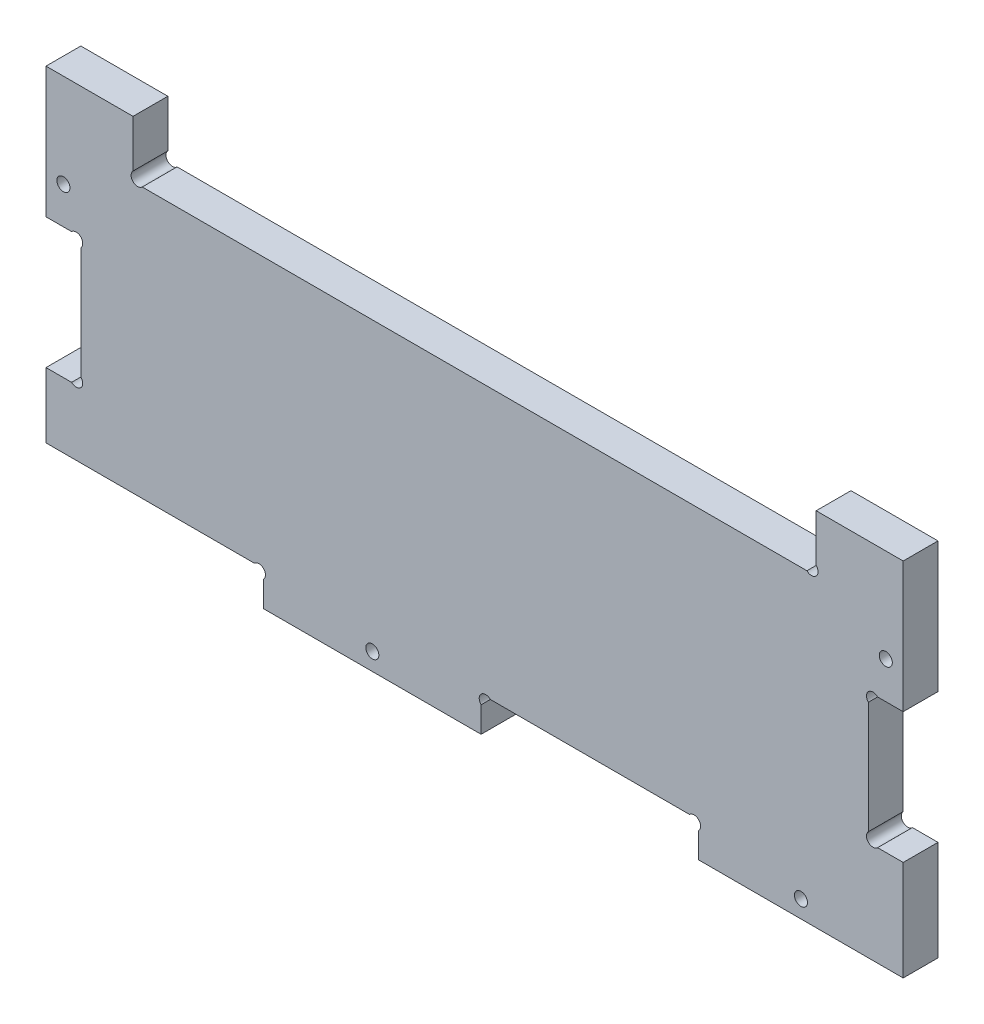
ISO-10303-21;
HEADER;
FILE_DESCRIPTION(('STEP AP214'),'2;1');
FILE_NAME('part.step','',(''),(''),'','','');
FILE_SCHEMA(('AUTOMOTIVE_DESIGN { 1 0 10303 214 1 1 1 1 }'));
ENDSEC;
DATA;
#1=APPLICATION_CONTEXT('core data for automotive mechanical design processes');
#2=APPLICATION_PROTOCOL_DEFINITION('international standard','automotive_design',2000,#1);
#3=PRODUCT_CONTEXT('',#1,'mechanical');
#4=PRODUCT('Part','Part','',(#3));
#5=PRODUCT_RELATED_PRODUCT_CATEGORY('part','',(#4));
#6=PRODUCT_DEFINITION_FORMATION('','',#4);
#7=PRODUCT_DEFINITION_CONTEXT('part definition',#1,'design');
#8=PRODUCT_DEFINITION('design','',#6,#7);
#9=PRODUCT_DEFINITION_SHAPE('','',#8);
#10=(LENGTH_UNIT() NAMED_UNIT(*) SI_UNIT(.MILLI.,.METRE.));
#11=(NAMED_UNIT(*) PLANE_ANGLE_UNIT() SI_UNIT($,.RADIAN.));
#12=(NAMED_UNIT(*) SI_UNIT($,.STERADIAN.) SOLID_ANGLE_UNIT());
#13=UNCERTAINTY_MEASURE_WITH_UNIT(LENGTH_MEASURE(1.E-05),#10,'distance_accuracy_value','');
#14=(GEOMETRIC_REPRESENTATION_CONTEXT(3) GLOBAL_UNCERTAINTY_ASSIGNED_CONTEXT((#13)) GLOBAL_UNIT_ASSIGNED_CONTEXT((#10,
#11,#12)) REPRESENTATION_CONTEXT('',''));
#15=CARTESIAN_POINT('',(0.,0.,0.));
#16=DIRECTION('',(0.,0.,1.));
#17=DIRECTION('',(1.,0.,0.));
#18=AXIS2_PLACEMENT_3D('',#15,#16,#17);
#19=CARTESIAN_POINT('',(2.12366434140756,46.4437720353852,8.));
#20=DIRECTION('',(0.,0.,1.));
#21=DIRECTION('',(1.,0.,0.));
#22=AXIS2_PLACEMENT_3D('',#19,#20,#21);
#23=PLANE('',#22);
#24=CARTESIAN_POINT('',(19.1843245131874,36.883111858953,8.));
#25=DIRECTION('',(0.,0.,1.));
#26=DIRECTION('',(1.,0.,0.));
#27=AXIS2_PLACEMENT_3D('',#24,#25,#26);
#28=CIRCLE('',#27,1.4999999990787);
#29=CARTESIAN_POINT('',(20.6843245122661,36.883111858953,8.));
#30=VERTEX_POINT('',#29);
#31=EDGE_CURVE('E865',#30,#30,#28,.T.);
#32=ORIENTED_EDGE('',*,*,#31,.F.);
#33=EDGE_LOOP('',(#32));
#34=FACE_BOUND('',#33,.T.);
#35=CARTESIAN_POINT('',(-98.8156754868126,-20.616888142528,8.));
#36=DIRECTION('',(0.,0.,1.));
#37=DIRECTION('',(1.,0.,0.));
#38=AXIS2_PLACEMENT_3D('',#35,#36,#37);
#39=CIRCLE('',#38,1.49999999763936);
#40=CARTESIAN_POINT('',(-97.3156754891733,-20.616888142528,8.));
#41=VERTEX_POINT('',#40);
#42=EDGE_CURVE('E269',#41,#41,#39,.T.);
#43=ORIENTED_EDGE('',*,*,#42,.F.);
#44=EDGE_LOOP('',(#43));
#45=FACE_BOUND('',#44,.T.);
#46=DIRECTION('',(0.,1.,0.));
#47=VECTOR('',#46,1.);
#48=CARTESIAN_POINT('',(23.1843245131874,28.3831118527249,8.));
#49=LINE('',#48,#47);
#50=CARTESIAN_POINT('',(23.1843245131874,28.3831118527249,8.));
#51=VERTEX_POINT('',#50);
#52=CARTESIAN_POINT('',(23.1843245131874,58.3831118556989,8.));
#53=VERTEX_POINT('',#52);
#54=EDGE_CURVE('E160',#51,#53,#49,.T.);
#55=ORIENTED_EDGE('',*,*,#54,.T.);
#56=DIRECTION('',(-1.,0.,0.));
#57=VECTOR('',#56,1.);
#58=CARTESIAN_POINT('',(23.1843245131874,58.3831118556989,8.));
#59=LINE('',#58,#57);
#60=CARTESIAN_POINT('',(3.18432451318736,58.3831118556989,8.));
#61=VERTEX_POINT('',#60);
#62=EDGE_CURVE('E492',#53,#61,#59,.T.);
#63=ORIENTED_EDGE('',*,*,#62,.T.);
#64=DIRECTION('',(0.,-1.,0.));
#65=VECTOR('',#64,1.);
#66=CARTESIAN_POINT('',(3.18432451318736,58.3831118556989,8.));
#67=LINE('',#66,#65);
#68=CARTESIAN_POINT('',(3.18432451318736,47.5044322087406,8.));
#69=VERTEX_POINT('',#68);
#70=EDGE_CURVE('E413',#61,#69,#67,.T.);
#71=ORIENTED_EDGE('',*,*,#70,.T.);
#72=CARTESIAN_POINT('',(2.12366434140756,46.4437720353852,8.));
#73=DIRECTION('',(0.,0.,-1.));
#74=DIRECTION('',(1.,0.,0.));
#75=AXIS2_PLACEMENT_3D('',#72,#73,#74);
#76=CIRCLE('',#75,1.50000000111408);
#77=CARTESIAN_POINT('',(1.06300416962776,45.3831118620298,8.));
#78=VERTEX_POINT('',#77);
#79=EDGE_CURVE('E432',#69,#78,#76,.T.);
#80=ORIENTED_EDGE('',*,*,#79,.T.);
#81=DIRECTION('',(-1.,0.,0.));
#82=VECTOR('',#81,1.);
#83=CARTESIAN_POINT('',(-151.694355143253,45.3831118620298,8.));
#84=LINE('',#83,#82);
#85=CARTESIAN_POINT('',(-151.694355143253,45.3831118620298,8.));
#86=VERTEX_POINT('',#85);
#87=EDGE_CURVE('E429',#78,#86,#84,.T.);
#88=ORIENTED_EDGE('',*,*,#87,.T.);
#89=CARTESIAN_POINT('',(-152.755015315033,46.4437720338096,8.));
#90=DIRECTION('',(0.,0.,-1.));
#91=DIRECTION('',(1.,0.,0.));
#92=AXIS2_PLACEMENT_3D('',#89,#90,#91);
#93=CIRCLE('',#92,1.4999999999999);
#94=CARTESIAN_POINT('',(-153.815675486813,47.5044322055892,8.));
#95=VERTEX_POINT('',#94);
#96=EDGE_CURVE('E431',#86,#95,#93,.T.);
#97=ORIENTED_EDGE('',*,*,#96,.T.);
#98=DIRECTION('',(0.,1.,0.));
#99=VECTOR('',#98,1.);
#100=CARTESIAN_POINT('',(-153.815675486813,58.3831118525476,8.));
#101=LINE('',#100,#99);
#102=CARTESIAN_POINT('',(-153.815675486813,58.3831118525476,8.));
#103=VERTEX_POINT('',#102);
#104=EDGE_CURVE('E434',#95,#103,#101,.T.);
#105=ORIENTED_EDGE('',*,*,#104,.T.);
#106=DIRECTION('',(-1.,0.,0.));
#107=VECTOR('',#106,1.);
#108=CARTESIAN_POINT('',(-173.815675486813,58.3831118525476,8.));
#109=LINE('',#108,#107);
#110=CARTESIAN_POINT('',(-173.815675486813,58.3831118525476,8.));
#111=VERTEX_POINT('',#110);
#112=EDGE_CURVE('E440',#103,#111,#109,.T.);
#113=ORIENTED_EDGE('',*,*,#112,.T.);
#114=DIRECTION('',(0.,-1.,0.));
#115=VECTOR('',#114,1.);
#116=CARTESIAN_POINT('',(-173.815675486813,45.3831118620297,8.));
#117=LINE('',#116,#115);
#118=CARTESIAN_POINT('',(-173.815675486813,28.3831118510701,8.));
#119=VERTEX_POINT('',#118);
#120=EDGE_CURVE('E442',#111,#119,#117,.T.);
#121=ORIENTED_EDGE('',*,*,#120,.T.);
#122=DIRECTION('',(1.,0.,0.));
#123=VECTOR('',#122,1.);
#124=CARTESIAN_POINT('',(-167.936995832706,28.3831118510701,8.));
#125=LINE('',#124,#123);
#126=CARTESIAN_POINT('',(-167.936995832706,28.3831118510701,8.));
#127=VERTEX_POINT('',#126);
#128=EDGE_CURVE('E444',#119,#127,#125,.T.);
#129=ORIENTED_EDGE('',*,*,#128,.T.);
#130=CARTESIAN_POINT('',(-166.876335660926,27.3224516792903,8.));
#131=DIRECTION('',(0.,0.,-1.));
#132=DIRECTION('',(1.,0.,0.));
#133=AXIS2_PLACEMENT_3D('',#130,#131,#132);
#134=CIRCLE('',#133,1.5);
#135=CARTESIAN_POINT('',(-165.815675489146,26.2617915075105,8.));
#136=VERTEX_POINT('',#135);
#137=EDGE_CURVE('E446',#127,#136,#134,.T.);
#138=ORIENTED_EDGE('',*,*,#137,.T.);
#139=DIRECTION('',(0.,-1.,0.));
#140=VECTOR('',#139,1.);
#141=CARTESIAN_POINT('',(-165.815675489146,0.504432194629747,8.));
#142=LINE('',#141,#140);
#143=CARTESIAN_POINT('',(-165.815675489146,0.504432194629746,8.));
#144=VERTEX_POINT('',#143);
#145=EDGE_CURVE('E448',#136,#144,#142,.T.);
#146=ORIENTED_EDGE('',*,*,#145,.T.);
#147=CARTESIAN_POINT('',(-166.876335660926,-0.556227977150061,8.));
#148=DIRECTION('',(0.,0.,-1.));
#149=DIRECTION('',(1.,0.,0.));
#150=AXIS2_PLACEMENT_3D('',#147,#148,#149);
#151=CIRCLE('',#150,1.5);
#152=CARTESIAN_POINT('',(-167.936995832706,-1.61688814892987,8.));
#153=VERTEX_POINT('',#152);
#154=EDGE_CURVE('E450',#144,#153,#151,.T.);
#155=ORIENTED_EDGE('',*,*,#154,.T.);
#156=DIRECTION('',(-1.,0.,0.));
#157=VECTOR('',#156,1.);
#158=CARTESIAN_POINT('',(-173.815675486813,-1.61688814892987,8.));
#159=LINE('',#158,#157);
#160=CARTESIAN_POINT('',(-173.815675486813,-1.61688814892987,8.));
#161=VERTEX_POINT('',#160);
#162=EDGE_CURVE('E452',#153,#161,#159,.T.);
#163=ORIENTED_EDGE('',*,*,#162,.T.);
#164=DIRECTION('',(0.,-1.,0.));
#165=VECTOR('',#164,1.);
#166=CARTESIAN_POINT('',(-173.815675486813,-16.6168881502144,8.));
#167=LINE('',#166,#165);
#168=CARTESIAN_POINT('',(-173.815675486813,-16.6168881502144,8.));
#169=VERTEX_POINT('',#168);
#170=EDGE_CURVE('E454',#161,#169,#167,.T.);
#171=ORIENTED_EDGE('',*,*,#170,.T.);
#172=DIRECTION('',(1.,0.,0.));
#173=VECTOR('',#172,1.);
#174=CARTESIAN_POINT('',(-125.936995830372,-16.6168881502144,8.));
#175=LINE('',#174,#173);
#176=CARTESIAN_POINT('',(-125.936995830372,-16.6168881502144,8.));
#177=VERTEX_POINT('',#176);
#178=EDGE_CURVE('E456',#169,#177,#175,.T.);
#179=ORIENTED_EDGE('',*,*,#178,.T.);
#180=CARTESIAN_POINT('',(-124.876335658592,-17.6775483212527,8.));
#181=DIRECTION('',(0.,0.,-1.));
#182=DIRECTION('',(1.,0.,0.));
#183=AXIS2_PLACEMENT_3D('',#180,#181,#182);
#184=CIRCLE('',#183,1.49999999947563);
#185=CARTESIAN_POINT('',(-123.815675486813,-18.738208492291,8.));
#186=VERTEX_POINT('',#185);
#187=EDGE_CURVE('E458',#177,#186,#184,.T.);
#188=ORIENTED_EDGE('',*,*,#187,.T.);
#189=DIRECTION('',(0.,-1.,0.));
#190=VECTOR('',#189,1.);
#191=CARTESIAN_POINT('',(-123.815675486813,-24.6168881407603,8.));
#192=LINE('',#191,#190);
#193=CARTESIAN_POINT('',(-123.815675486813,-24.6168881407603,8.));
#194=VERTEX_POINT('',#193);
#195=EDGE_CURVE('E460',#186,#194,#192,.T.);
#196=ORIENTED_EDGE('',*,*,#195,.T.);
#197=DIRECTION('',(1.,0.,0.));
#198=VECTOR('',#197,1.);
#199=CARTESIAN_POINT('',(-73.8156754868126,-24.6168881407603,8.));
#200=LINE('',#199,#198);
#201=CARTESIAN_POINT('',(-73.8156754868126,-24.6168881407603,8.));
#202=VERTEX_POINT('',#201);
#203=EDGE_CURVE('E462',#194,#202,#200,.T.);
#204=ORIENTED_EDGE('',*,*,#203,.T.);
#205=DIRECTION('',(0.,1.,0.));
#206=VECTOR('',#205,1.);
#207=CARTESIAN_POINT('',(-73.8156754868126,-18.738208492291,8.));
#208=LINE('',#207,#206);
#209=CARTESIAN_POINT('',(-73.8156754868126,-18.738208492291,8.));
#210=VERTEX_POINT('',#209);
#211=EDGE_CURVE('E464',#202,#210,#208,.T.);
#212=ORIENTED_EDGE('',*,*,#211,.T.);
#213=CARTESIAN_POINT('',(-72.7550153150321,-17.6775483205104,8.));
#214=DIRECTION('',(0.,0.,-1.));
#215=DIRECTION('',(1.,0.,0.));
#216=AXIS2_PLACEMENT_3D('',#213,#214,#215);
#217=CIRCLE('',#216,1.50000000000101);
#218=CARTESIAN_POINT('',(-71.694355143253,-16.6168881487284,8.));
#219=VERTEX_POINT('',#218);
#220=EDGE_CURVE('E466',#210,#219,#217,.T.);
#221=ORIENTED_EDGE('',*,*,#220,.T.);
#222=DIRECTION('',(1.,0.,0.));
#223=VECTOR('',#222,1.);
#224=CARTESIAN_POINT('',(-71.694355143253,-16.6168881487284,8.));
#225=LINE('',#224,#223);
#226=CARTESIAN_POINT('',(-25.9369958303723,-16.6168881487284,8.));
#227=VERTEX_POINT('',#226);
#228=EDGE_CURVE('E468',#219,#227,#225,.T.);
#229=ORIENTED_EDGE('',*,*,#228,.T.);
#230=CARTESIAN_POINT('',(-24.8763356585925,-17.6775483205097,8.));
#231=DIRECTION('',(0.,0.,-1.));
#232=DIRECTION('',(1.,0.,0.));
#233=AXIS2_PLACEMENT_3D('',#230,#231,#232);
#234=CIRCLE('',#233,1.50000000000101);
#235=CARTESIAN_POINT('',(-23.8156754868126,-18.7382084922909,8.));
#236=VERTEX_POINT('',#235);
#237=EDGE_CURVE('E470',#227,#236,#234,.T.);
#238=ORIENTED_EDGE('',*,*,#237,.T.);
#239=DIRECTION('',(0.,-1.,0.));
#240=VECTOR('',#239,1.);
#241=CARTESIAN_POINT('',(-23.8156754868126,-24.6168881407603,8.));
#242=LINE('',#241,#240);
#243=CARTESIAN_POINT('',(-23.8156754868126,-24.6168881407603,8.));
#244=VERTEX_POINT('',#243);
#245=EDGE_CURVE('E472',#236,#244,#242,.T.);
#246=ORIENTED_EDGE('',*,*,#245,.T.);
#247=DIRECTION('',(1.,2.68797543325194E-10,0.));
#248=VECTOR('',#247,1.);
#249=CARTESIAN_POINT('',(23.1843245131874,-24.6168881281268,8.));
#250=LINE('',#249,#248);
#251=CARTESIAN_POINT('',(23.1843245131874,-24.6168881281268,8.));
#252=VERTEX_POINT('',#251);
#253=EDGE_CURVE('E474',#244,#252,#250,.T.);
#254=ORIENTED_EDGE('',*,*,#253,.T.);
#255=DIRECTION('',(0.,1.,0.));
#256=VECTOR('',#255,1.);
#257=CARTESIAN_POINT('',(23.1843245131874,-24.6168881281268,8.));
#258=LINE('',#257,#256);
#259=CARTESIAN_POINT('',(23.1843245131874,-1.61688814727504,8.));
#260=VERTEX_POINT('',#259);
#261=EDGE_CURVE('E476',#252,#260,#258,.T.);
#262=ORIENTED_EDGE('',*,*,#261,.T.);
#263=DIRECTION('',(-1.,0.,0.));
#264=VECTOR('',#263,1.);
#265=CARTESIAN_POINT('',(17.3056448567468,-1.61688814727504,8.));
#266=LINE('',#265,#264);
#267=CARTESIAN_POINT('',(17.3056448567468,-1.61688814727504,8.));
#268=VERTEX_POINT('',#267);
#269=EDGE_CURVE('E478',#260,#268,#266,.T.);
#270=ORIENTED_EDGE('',*,*,#269,.T.);
#271=CARTESIAN_POINT('',(16.2449846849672,-0.556227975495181,8.));
#272=DIRECTION('',(0.,0.,-1.));
#273=DIRECTION('',(1.,0.,0.));
#274=AXIS2_PLACEMENT_3D('',#271,#272,#273);
#275=CIRCLE('',#274,1.49999999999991);
#276=CARTESIAN_POINT('',(15.1843245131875,0.504432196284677,8.));
#277=VERTEX_POINT('',#276);
#278=EDGE_CURVE('E249',#268,#277,#275,.T.);
#279=ORIENTED_EDGE('',*,*,#278,.T.);
#280=DIRECTION('',(0.,1.,0.));
#281=VECTOR('',#280,1.);
#282=CARTESIAN_POINT('',(15.1843245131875,26.2617915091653,8.));
#283=LINE('',#282,#281);
#284=CARTESIAN_POINT('',(15.1843245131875,26.2617915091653,8.));
#285=VERTEX_POINT('',#284);
#286=EDGE_CURVE('E243',#277,#285,#283,.T.);
#287=ORIENTED_EDGE('',*,*,#286,.T.);
#288=CARTESIAN_POINT('',(16.2449846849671,27.3224516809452,8.));
#289=DIRECTION('',(0.,0.,-1.));
#290=DIRECTION('',(1.,0.,0.));
#291=AXIS2_PLACEMENT_3D('',#288,#289,#290);
#292=CIRCLE('',#291,1.49999999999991);
#293=CARTESIAN_POINT('',(17.3056448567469,28.3831118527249,8.));
#294=VERTEX_POINT('',#293);
#295=EDGE_CURVE('E247',#285,#294,#292,.T.);
#296=ORIENTED_EDGE('',*,*,#295,.T.);
#297=DIRECTION('',(1.,0.,0.));
#298=VECTOR('',#297,1.);
#299=CARTESIAN_POINT('',(23.1843245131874,28.3831118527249,8.));
#300=LINE('',#299,#298);
#301=EDGE_CURVE('E49',#294,#51,#300,.T.);
#302=ORIENTED_EDGE('',*,*,#301,.T.);
#303=EDGE_LOOP('',(#55,#63,#71,#80,#88,#97,#105,#113,#121,#129,#138,#146,#155,#163,#171,#179,
#188,#196,#204,#212,#221,#229,#238,#246,#254,#262,#270,#279,#287,#296,#302));
#304=FACE_BOUND('',#303,.T.);
#305=CARTESIAN_POINT('',(-0.31567548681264,-20.6168881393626,8.));
#306=DIRECTION('',(0.,0.,1.));
#307=DIRECTION('',(1.,0.,0.));
#308=AXIS2_PLACEMENT_3D('',#305,#306,#307);
#309=CIRCLE('',#308,1.49999999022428);
#310=CARTESIAN_POINT('',(1.18432450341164,-20.6168881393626,8.));
#311=VERTEX_POINT('',#310);
#312=EDGE_CURVE('E871',#311,#311,#309,.T.);
#313=ORIENTED_EDGE('',*,*,#312,.F.);
#314=EDGE_LOOP('',(#313));
#315=FACE_BOUND('',#314,.T.);
#316=CARTESIAN_POINT('',(-169.815675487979,36.8831118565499,8.));
#317=DIRECTION('',(0.,0.,1.));
#318=DIRECTION('',(1.,0.,0.));
#319=AXIS2_PLACEMENT_3D('',#316,#317,#318);
#320=CIRCLE('',#319,1.5);
#321=CARTESIAN_POINT('',(-168.315675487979,36.8831118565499,8.));
#322=VERTEX_POINT('',#321);
#323=EDGE_CURVE('E856',#322,#322,#320,.T.);
#324=ORIENTED_EDGE('',*,*,#323,.F.);
#325=EDGE_LOOP('',(#324));
#326=FACE_BOUND('',#325,.T.);
#327=ADVANCED_FACE('F32',(#34,#45,#304,#315,#326),#23,.T.);
#328=CARTESIAN_POINT('',(2.12366434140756,46.4437720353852,0.));
#329=DIRECTION('',(0.,0.,1.));
#330=DIRECTION('',(1.,0.,0.));
#331=AXIS2_PLACEMENT_3D('',#328,#329,#330);
#332=PLANE('',#331);
#333=CARTESIAN_POINT('',(19.1843245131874,36.883111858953,0.));
#334=DIRECTION('',(0.,0.,1.));
#335=DIRECTION('',(1.,0.,0.));
#336=AXIS2_PLACEMENT_3D('',#333,#334,#335);
#337=CIRCLE('',#336,1.4999999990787);
#338=CARTESIAN_POINT('',(20.6843245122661,36.883111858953,0.));
#339=VERTEX_POINT('',#338);
#340=EDGE_CURVE('E862',#339,#339,#337,.T.);
#341=ORIENTED_EDGE('',*,*,#340,.T.);
#342=EDGE_LOOP('',(#341));
#343=FACE_BOUND('',#342,.T.);
#344=CARTESIAN_POINT('',(-98.8156754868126,-20.616888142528,0.));
#345=DIRECTION('',(0.,0.,1.));
#346=DIRECTION('',(1.,0.,0.));
#347=AXIS2_PLACEMENT_3D('',#344,#345,#346);
#348=CIRCLE('',#347,1.49999999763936);
#349=CARTESIAN_POINT('',(-97.3156754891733,-20.616888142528,0.));
#350=VERTEX_POINT('',#349);
#351=EDGE_CURVE('E496',#350,#350,#348,.T.);
#352=ORIENTED_EDGE('',*,*,#351,.T.);
#353=EDGE_LOOP('',(#352));
#354=FACE_BOUND('',#353,.T.);
#355=DIRECTION('',(0.,1.,0.));
#356=VECTOR('',#355,1.);
#357=CARTESIAN_POINT('',(23.1843245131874,45.383111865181,0.));
#358=LINE('',#357,#356);
#359=CARTESIAN_POINT('',(23.1843245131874,28.3831118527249,0.));
#360=VERTEX_POINT('',#359);
#361=CARTESIAN_POINT('',(23.1843245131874,58.3831118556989,0.));
#362=VERTEX_POINT('',#361);
#363=EDGE_CURVE('E154',#360,#362,#358,.T.);
#364=ORIENTED_EDGE('',*,*,#363,.F.);
#365=DIRECTION('',(1.,0.,0.));
#366=VECTOR('',#365,1.);
#367=CARTESIAN_POINT('',(23.1843245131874,28.3831118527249,0.));
#368=LINE('',#367,#366);
#369=CARTESIAN_POINT('',(17.3056448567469,28.3831118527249,0.));
#370=VERTEX_POINT('',#369);
#371=EDGE_CURVE('E326',#370,#360,#368,.T.);
#372=ORIENTED_EDGE('',*,*,#371,.F.);
#373=CARTESIAN_POINT('',(16.2449846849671,27.3224516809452,0.));
#374=DIRECTION('',(0.,0.,-1.));
#375=DIRECTION('',(1.,0.,0.));
#376=AXIS2_PLACEMENT_3D('',#373,#374,#375);
#377=CIRCLE('',#376,1.49999999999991);
#378=CARTESIAN_POINT('',(15.1843245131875,26.2617915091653,0.));
#379=VERTEX_POINT('',#378);
#380=EDGE_CURVE('E147',#379,#370,#377,.T.);
#381=ORIENTED_EDGE('',*,*,#380,.F.);
#382=DIRECTION('',(0.,1.,0.));
#383=VECTOR('',#382,1.);
#384=CARTESIAN_POINT('',(15.1843245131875,26.2617915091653,0.));
#385=LINE('',#384,#383);
#386=CARTESIAN_POINT('',(15.1843245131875,0.504432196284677,0.));
#387=VERTEX_POINT('',#386);
#388=EDGE_CURVE('E257',#387,#379,#385,.T.);
#389=ORIENTED_EDGE('',*,*,#388,.F.);
#390=CARTESIAN_POINT('',(16.2449846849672,-0.556227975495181,0.));
#391=DIRECTION('',(0.,0.,-1.));
#392=DIRECTION('',(1.,0.,0.));
#393=AXIS2_PLACEMENT_3D('',#390,#391,#392);
#394=CIRCLE('',#393,1.49999999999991);
#395=CARTESIAN_POINT('',(17.3056448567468,-1.61688814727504,0.));
#396=VERTEX_POINT('',#395);
#397=EDGE_CURVE('E322',#396,#387,#394,.T.);
#398=ORIENTED_EDGE('',*,*,#397,.F.);
#399=DIRECTION('',(-1.,0.,0.));
#400=VECTOR('',#399,1.);
#401=CARTESIAN_POINT('',(17.3056448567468,-1.61688814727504,0.));
#402=LINE('',#401,#400);
#403=CARTESIAN_POINT('',(23.1843245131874,-1.61688814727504,0.));
#404=VERTEX_POINT('',#403);
#405=EDGE_CURVE('E320',#404,#396,#402,.T.);
#406=ORIENTED_EDGE('',*,*,#405,.F.);
#407=DIRECTION('',(0.,1.,0.));
#408=VECTOR('',#407,1.);
#409=CARTESIAN_POINT('',(23.1843245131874,-24.6168881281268,0.));
#410=LINE('',#409,#408);
#411=CARTESIAN_POINT('',(23.1843245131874,-24.6168881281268,0.));
#412=VERTEX_POINT('',#411);
#413=EDGE_CURVE('E318',#412,#404,#410,.T.);
#414=ORIENTED_EDGE('',*,*,#413,.F.);
#415=DIRECTION('',(1.,2.68797543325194E-10,0.));
#416=VECTOR('',#415,1.);
#417=CARTESIAN_POINT('',(23.1843245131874,-24.6168881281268,0.));
#418=LINE('',#417,#416);
#419=CARTESIAN_POINT('',(-23.8156754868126,-24.6168881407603,0.));
#420=VERTEX_POINT('',#419);
#421=EDGE_CURVE('E316',#420,#412,#418,.T.);
#422=ORIENTED_EDGE('',*,*,#421,.F.);
#423=DIRECTION('',(0.,-1.,0.));
#424=VECTOR('',#423,1.);
#425=CARTESIAN_POINT('',(-23.8156754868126,-24.6168881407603,0.));
#426=LINE('',#425,#424);
#427=CARTESIAN_POINT('',(-23.8156754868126,-18.7382084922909,0.));
#428=VERTEX_POINT('',#427);
#429=EDGE_CURVE('E314',#428,#420,#426,.T.);
#430=ORIENTED_EDGE('',*,*,#429,.F.);
#431=CARTESIAN_POINT('',(-24.8763356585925,-17.6775483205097,0.));
#432=DIRECTION('',(0.,0.,-1.));
#433=DIRECTION('',(1.,0.,0.));
#434=AXIS2_PLACEMENT_3D('',#431,#432,#433);
#435=CIRCLE('',#434,1.50000000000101);
#436=CARTESIAN_POINT('',(-25.9369958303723,-16.6168881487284,0.));
#437=VERTEX_POINT('',#436);
#438=EDGE_CURVE('E312',#437,#428,#435,.T.);
#439=ORIENTED_EDGE('',*,*,#438,.F.);
#440=DIRECTION('',(1.,0.,0.));
#441=VECTOR('',#440,1.);
#442=CARTESIAN_POINT('',(-71.694355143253,-16.6168881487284,0.));
#443=LINE('',#442,#441);
#444=CARTESIAN_POINT('',(-71.694355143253,-16.6168881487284,0.));
#445=VERTEX_POINT('',#444);
#446=EDGE_CURVE('E310',#445,#437,#443,.T.);
#447=ORIENTED_EDGE('',*,*,#446,.F.);
#448=CARTESIAN_POINT('',(-72.7550153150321,-17.6775483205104,0.));
#449=DIRECTION('',(0.,0.,-1.));
#450=DIRECTION('',(1.,0.,0.));
#451=AXIS2_PLACEMENT_3D('',#448,#449,#450);
#452=CIRCLE('',#451,1.50000000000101);
#453=CARTESIAN_POINT('',(-73.8156754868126,-18.738208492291,0.));
#454=VERTEX_POINT('',#453);
#455=EDGE_CURVE('E308',#454,#445,#452,.T.);
#456=ORIENTED_EDGE('',*,*,#455,.F.);
#457=DIRECTION('',(0.,1.,0.));
#458=VECTOR('',#457,1.);
#459=CARTESIAN_POINT('',(-73.8156754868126,-18.738208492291,0.));
#460=LINE('',#459,#458);
#461=CARTESIAN_POINT('',(-73.8156754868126,-24.6168881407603,0.));
#462=VERTEX_POINT('',#461);
#463=EDGE_CURVE('E306',#462,#454,#460,.T.);
#464=ORIENTED_EDGE('',*,*,#463,.F.);
#465=DIRECTION('',(1.,0.,0.));
#466=VECTOR('',#465,1.);
#467=CARTESIAN_POINT('',(-73.8156754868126,-24.6168881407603,0.));
#468=LINE('',#467,#466);
#469=CARTESIAN_POINT('',(-123.815675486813,-24.6168881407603,0.));
#470=VERTEX_POINT('',#469);
#471=EDGE_CURVE('E304',#470,#462,#468,.T.);
#472=ORIENTED_EDGE('',*,*,#471,.F.);
#473=DIRECTION('',(0.,-1.,0.));
#474=VECTOR('',#473,1.);
#475=CARTESIAN_POINT('',(-123.815675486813,-24.6168881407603,0.));
#476=LINE('',#475,#474);
#477=CARTESIAN_POINT('',(-123.815675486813,-18.738208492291,0.));
#478=VERTEX_POINT('',#477);
#479=EDGE_CURVE('E302',#478,#470,#476,.T.);
#480=ORIENTED_EDGE('',*,*,#479,.F.);
#481=CARTESIAN_POINT('',(-124.876335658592,-17.6775483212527,0.));
#482=DIRECTION('',(0.,0.,-1.));
#483=DIRECTION('',(1.,0.,0.));
#484=AXIS2_PLACEMENT_3D('',#481,#482,#483);
#485=CIRCLE('',#484,1.49999999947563);
#486=CARTESIAN_POINT('',(-125.936995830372,-16.6168881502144,0.));
#487=VERTEX_POINT('',#486);
#488=EDGE_CURVE('E300',#487,#478,#485,.T.);
#489=ORIENTED_EDGE('',*,*,#488,.F.);
#490=DIRECTION('',(1.,0.,0.));
#491=VECTOR('',#490,1.);
#492=CARTESIAN_POINT('',(-125.936995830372,-16.6168881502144,0.));
#493=LINE('',#492,#491);
#494=CARTESIAN_POINT('',(-173.815675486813,-16.6168881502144,0.));
#495=VERTEX_POINT('',#494);
#496=EDGE_CURVE('E298',#495,#487,#493,.T.);
#497=ORIENTED_EDGE('',*,*,#496,.F.);
#498=DIRECTION('',(0.,-1.,0.));
#499=VECTOR('',#498,1.);
#500=CARTESIAN_POINT('',(-173.815675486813,-16.6168881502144,0.));
#501=LINE('',#500,#499);
#502=CARTESIAN_POINT('',(-173.815675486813,-1.61688814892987,0.));
#503=VERTEX_POINT('',#502);
#504=EDGE_CURVE('E296',#503,#495,#501,.T.);
#505=ORIENTED_EDGE('',*,*,#504,.F.);
#506=DIRECTION('',(-1.,0.,0.));
#507=VECTOR('',#506,1.);
#508=CARTESIAN_POINT('',(-173.815675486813,-1.61688814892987,0.));
#509=LINE('',#508,#507);
#510=CARTESIAN_POINT('',(-167.936995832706,-1.61688814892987,0.));
#511=VERTEX_POINT('',#510);
#512=EDGE_CURVE('E294',#511,#503,#509,.T.);
#513=ORIENTED_EDGE('',*,*,#512,.F.);
#514=CARTESIAN_POINT('',(-166.876335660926,-0.556227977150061,0.));
#515=DIRECTION('',(0.,0.,-1.));
#516=DIRECTION('',(1.,0.,0.));
#517=AXIS2_PLACEMENT_3D('',#514,#515,#516);
#518=CIRCLE('',#517,1.5);
#519=CARTESIAN_POINT('',(-165.815675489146,0.504432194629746,0.));
#520=VERTEX_POINT('',#519);
#521=EDGE_CURVE('E292',#520,#511,#518,.T.);
#522=ORIENTED_EDGE('',*,*,#521,.F.);
#523=DIRECTION('',(0.,-1.,0.));
#524=VECTOR('',#523,1.);
#525=CARTESIAN_POINT('',(-165.815675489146,0.504432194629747,0.));
#526=LINE('',#525,#524);
#527=CARTESIAN_POINT('',(-165.815675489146,26.2617915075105,0.));
#528=VERTEX_POINT('',#527);
#529=EDGE_CURVE('E290',#528,#520,#526,.T.);
#530=ORIENTED_EDGE('',*,*,#529,.F.);
#531=CARTESIAN_POINT('',(-166.876335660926,27.3224516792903,0.));
#532=DIRECTION('',(0.,0.,-1.));
#533=DIRECTION('',(1.,0.,0.));
#534=AXIS2_PLACEMENT_3D('',#531,#532,#533);
#535=CIRCLE('',#534,1.5);
#536=CARTESIAN_POINT('',(-167.936995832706,28.3831118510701,0.));
#537=VERTEX_POINT('',#536);
#538=EDGE_CURVE('E288',#537,#528,#535,.T.);
#539=ORIENTED_EDGE('',*,*,#538,.F.);
#540=DIRECTION('',(1.,0.,0.));
#541=VECTOR('',#540,1.);
#542=CARTESIAN_POINT('',(-167.936995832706,28.3831118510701,0.));
#543=LINE('',#542,#541);
#544=CARTESIAN_POINT('',(-173.815675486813,28.3831118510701,0.));
#545=VERTEX_POINT('',#544);
#546=EDGE_CURVE('E286',#545,#537,#543,.T.);
#547=ORIENTED_EDGE('',*,*,#546,.F.);
#548=DIRECTION('',(0.,-1.,0.));
#549=VECTOR('',#548,1.);
#550=CARTESIAN_POINT('',(-173.815675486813,28.3831118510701,0.));
#551=LINE('',#550,#549);
#552=CARTESIAN_POINT('',(-173.815675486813,58.3831118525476,0.));
#553=VERTEX_POINT('',#552);
#554=EDGE_CURVE('E284',#553,#545,#551,.T.);
#555=ORIENTED_EDGE('',*,*,#554,.F.);
#556=DIRECTION('',(-1.,0.,0.));
#557=VECTOR('',#556,1.);
#558=CARTESIAN_POINT('',(-173.815675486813,58.3831118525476,0.));
#559=LINE('',#558,#557);
#560=CARTESIAN_POINT('',(-153.815675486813,58.3831118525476,0.));
#561=VERTEX_POINT('',#560);
#562=EDGE_CURVE('E281',#561,#553,#559,.T.);
#563=ORIENTED_EDGE('',*,*,#562,.F.);
#564=DIRECTION('',(0.,1.,0.));
#565=VECTOR('',#564,1.);
#566=CARTESIAN_POINT('',(-153.815675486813,58.3831118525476,0.));
#567=LINE('',#566,#565);
#568=CARTESIAN_POINT('',(-153.815675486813,47.5044322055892,0.));
#569=VERTEX_POINT('',#568);
#570=EDGE_CURVE('E279',#569,#561,#567,.T.);
#571=ORIENTED_EDGE('',*,*,#570,.F.);
#572=CARTESIAN_POINT('',(-152.755015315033,46.4437720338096,0.));
#573=DIRECTION('',(0.,0.,-1.));
#574=DIRECTION('',(1.,0.,0.));
#575=AXIS2_PLACEMENT_3D('',#572,#573,#574);
#576=CIRCLE('',#575,1.4999999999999);
#577=CARTESIAN_POINT('',(-151.694355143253,45.3831118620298,0.));
#578=VERTEX_POINT('',#577);
#579=EDGE_CURVE('E277',#578,#569,#576,.T.);
#580=ORIENTED_EDGE('',*,*,#579,.F.);
#581=DIRECTION('',(-1.,0.,0.));
#582=VECTOR('',#581,1.);
#583=CARTESIAN_POINT('',(-151.694355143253,45.3831118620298,0.));
#584=LINE('',#583,#582);
#585=CARTESIAN_POINT('',(1.06300416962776,45.3831118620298,0.));
#586=VERTEX_POINT('',#585);
#587=EDGE_CURVE('E275',#586,#578,#584,.T.);
#588=ORIENTED_EDGE('',*,*,#587,.F.);
#589=CARTESIAN_POINT('',(2.12366434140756,46.4437720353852,0.));
#590=DIRECTION('',(0.,0.,-1.));
#591=DIRECTION('',(1.,0.,0.));
#592=AXIS2_PLACEMENT_3D('',#589,#590,#591);
#593=CIRCLE('',#592,1.50000000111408);
#594=CARTESIAN_POINT('',(3.18432451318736,47.5044322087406,0.));
#595=VERTEX_POINT('',#594);
#596=EDGE_CURVE('E273',#595,#586,#593,.T.);
#597=ORIENTED_EDGE('',*,*,#596,.F.);
#598=DIRECTION('',(0.,-1.,0.));
#599=VECTOR('',#598,1.);
#600=CARTESIAN_POINT('',(3.18432451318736,58.3831118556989,0.));
#601=LINE('',#600,#599);
#602=CARTESIAN_POINT('',(3.18432451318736,58.3831118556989,0.));
#603=VERTEX_POINT('',#602);
#604=EDGE_CURVE('E271',#603,#595,#601,.T.);
#605=ORIENTED_EDGE('',*,*,#604,.F.);
#606=DIRECTION('',(-1.,0.,0.));
#607=VECTOR('',#606,1.);
#608=CARTESIAN_POINT('',(23.1843245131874,58.3831118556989,0.));
#609=LINE('',#608,#607);
#610=EDGE_CURVE('E268',#362,#603,#609,.T.);
#611=ORIENTED_EDGE('',*,*,#610,.F.);
#612=EDGE_LOOP('',(#364,#372,#381,#389,#398,#406,#414,#422,#430,#439,#447,#456,#464,#472,#480,
#489,#497,#505,#513,#522,#530,#539,#547,#555,#563,#571,#580,#588,#597,#605,#611));
#613=FACE_BOUND('',#612,.T.);
#614=CARTESIAN_POINT('',(-0.31567548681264,-20.6168881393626,0.));
#615=DIRECTION('',(0.,0.,1.));
#616=DIRECTION('',(1.,0.,0.));
#617=AXIS2_PLACEMENT_3D('',#614,#615,#616);
#618=CIRCLE('',#617,1.49999999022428);
#619=CARTESIAN_POINT('',(1.18432450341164,-20.6168881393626,0.));
#620=VERTEX_POINT('',#619);
#621=EDGE_CURVE('E868',#620,#620,#618,.T.);
#622=ORIENTED_EDGE('',*,*,#621,.T.);
#623=EDGE_LOOP('',(#622));
#624=FACE_BOUND('',#623,.T.);
#625=CARTESIAN_POINT('',(-169.815675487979,36.8831118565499,0.));
#626=DIRECTION('',(0.,0.,1.));
#627=DIRECTION('',(1.,0.,0.));
#628=AXIS2_PLACEMENT_3D('',#625,#626,#627);
#629=CIRCLE('',#628,1.5);
#630=CARTESIAN_POINT('',(-168.315675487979,36.8831118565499,0.));
#631=VERTEX_POINT('',#630);
#632=EDGE_CURVE('E859',#631,#631,#629,.T.);
#633=ORIENTED_EDGE('',*,*,#632,.T.);
#634=EDGE_LOOP('',(#633));
#635=FACE_BOUND('',#634,.T.);
#636=ADVANCED_FACE('F417',(#343,#354,#613,#624,#635),#332,.F.);
#637=CARTESIAN_POINT('',(23.1843245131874,45.383111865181,8.));
#638=DIRECTION('',(-1.,0.,0.));
#639=DIRECTION('',(0.,0.,1.));
#640=AXIS2_PLACEMENT_3D('',#637,#638,#639);
#641=PLANE('',#640);
#642=ORIENTED_EDGE('',*,*,#363,.T.);
#643=DIRECTION('',(0.,0.,-1.));
#644=VECTOR('',#643,1.);
#645=CARTESIAN_POINT('',(23.1843245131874,58.3831118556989,8.));
#646=LINE('',#645,#644);
#647=EDGE_CURVE('E11',#53,#362,#646,.T.);
#648=ORIENTED_EDGE('',*,*,#647,.F.);
#649=ORIENTED_EDGE('',*,*,#54,.F.);
#650=DIRECTION('',(0.,0.,-1.));
#651=VECTOR('',#650,1.);
#652=CARTESIAN_POINT('',(23.1843245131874,28.3831118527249,8.));
#653=LINE('',#652,#651);
#654=EDGE_CURVE('E263',#51,#360,#653,.T.);
#655=ORIENTED_EDGE('',*,*,#654,.T.);
#656=EDGE_LOOP('',(#642,#648,#649,#655));
#657=FACE_BOUND('',#656,.T.);
#658=ADVANCED_FACE('F34',(#657),#641,.F.);
#659=CARTESIAN_POINT('',(23.1843245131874,58.3831118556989,8.));
#660=DIRECTION('',(0.,-1.,0.));
#661=DIRECTION('',(0.,0.,-1.));
#662=AXIS2_PLACEMENT_3D('',#659,#660,#661);
#663=PLANE('',#662);
#664=ORIENTED_EDGE('',*,*,#610,.T.);
#665=DIRECTION('',(0.,0.,-1.));
#666=VECTOR('',#665,1.);
#667=CARTESIAN_POINT('',(3.18432451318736,58.3831118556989,8.));
#668=LINE('',#667,#666);
#669=EDGE_CURVE('E41',#61,#603,#668,.T.);
#670=ORIENTED_EDGE('',*,*,#669,.F.);
#671=ORIENTED_EDGE('',*,*,#62,.F.);
#672=ORIENTED_EDGE('',*,*,#647,.T.);
#673=EDGE_LOOP('',(#664,#670,#671,#672));
#674=FACE_BOUND('',#673,.T.);
#675=ADVANCED_FACE('F498',(#674),#663,.F.);
#676=CARTESIAN_POINT('',(3.18432451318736,58.3831118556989,8.));
#677=DIRECTION('',(1.,0.,0.));
#678=DIRECTION('',(0.,1.,0.));
#679=AXIS2_PLACEMENT_3D('',#676,#677,#678);
#680=PLANE('',#679);
#681=ORIENTED_EDGE('',*,*,#604,.T.);
#682=DIRECTION('',(0.,0.,-1.));
#683=VECTOR('',#682,1.);
#684=CARTESIAN_POINT('',(3.18432451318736,47.5044322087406,8.));
#685=LINE('',#684,#683);
#686=EDGE_CURVE('E404',#69,#595,#685,.T.);
#687=ORIENTED_EDGE('',*,*,#686,.F.);
#688=ORIENTED_EDGE('',*,*,#70,.F.);
#689=ORIENTED_EDGE('',*,*,#669,.T.);
#690=EDGE_LOOP('',(#681,#687,#688,#689));
#691=FACE_BOUND('',#690,.T.);
#692=ADVANCED_FACE('F411',(#691),#680,.F.);
#693=CARTESIAN_POINT('',(2.12366434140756,46.4437720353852,8.));
#694=DIRECTION('',(0.,0.,-1.));
#695=DIRECTION('',(-1.,0.,0.));
#696=AXIS2_PLACEMENT_3D('',#693,#694,#695);
#697=CYLINDRICAL_SURFACE('',#696,1.50000000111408);
#698=ORIENTED_EDGE('',*,*,#596,.T.);
#699=DIRECTION('',(0.,0.,-1.));
#700=VECTOR('',#699,1.);
#701=CARTESIAN_POINT('',(1.06300416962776,45.3831118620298,8.));
#702=LINE('',#701,#700);
#703=EDGE_CURVE('E401',#78,#586,#702,.T.);
#704=ORIENTED_EDGE('',*,*,#703,.F.);
#705=ORIENTED_EDGE('',*,*,#79,.F.);
#706=ORIENTED_EDGE('',*,*,#686,.T.);
#707=EDGE_LOOP('',(#698,#704,#705,#706));
#708=FACE_BOUND('',#707,.T.);
#709=ADVANCED_FACE('F423',(#708),#697,.F.);
#710=CARTESIAN_POINT('',(-151.694355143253,45.3831118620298,8.));
#711=DIRECTION('',(0.,-1.,0.));
#712=DIRECTION('',(0.,0.,-1.));
#713=AXIS2_PLACEMENT_3D('',#710,#711,#712);
#714=PLANE('',#713);
#715=ORIENTED_EDGE('',*,*,#587,.T.);
#716=DIRECTION('',(0.,0.,-1.));
#717=VECTOR('',#716,1.);
#718=CARTESIAN_POINT('',(-151.694355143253,45.3831118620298,8.));
#719=LINE('',#718,#717);
#720=EDGE_CURVE('E398',#86,#578,#719,.T.);
#721=ORIENTED_EDGE('',*,*,#720,.F.);
#722=ORIENTED_EDGE('',*,*,#87,.F.);
#723=ORIENTED_EDGE('',*,*,#703,.T.);
#724=EDGE_LOOP('',(#715,#721,#722,#723));
#725=FACE_BOUND('',#724,.T.);
#726=ADVANCED_FACE('F427',(#725),#714,.F.);
#727=CARTESIAN_POINT('',(-152.755015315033,46.4437720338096,8.));
#728=DIRECTION('',(0.,0.,-1.));
#729=DIRECTION('',(-1.,0.,0.));
#730=AXIS2_PLACEMENT_3D('',#727,#728,#729);
#731=CYLINDRICAL_SURFACE('',#730,1.4999999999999);
#732=ORIENTED_EDGE('',*,*,#579,.T.);
#733=DIRECTION('',(0.,0.,-1.));
#734=VECTOR('',#733,1.);
#735=CARTESIAN_POINT('',(-153.815675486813,47.5044322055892,8.));
#736=LINE('',#735,#734);
#737=EDGE_CURVE('E395',#95,#569,#736,.T.);
#738=ORIENTED_EDGE('',*,*,#737,.F.);
#739=ORIENTED_EDGE('',*,*,#96,.F.);
#740=ORIENTED_EDGE('',*,*,#720,.T.);
#741=EDGE_LOOP('',(#732,#738,#739,#740));
#742=FACE_BOUND('',#741,.T.);
#743=ADVANCED_FACE('F608',(#742),#731,.F.);
#744=CARTESIAN_POINT('',(-153.815675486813,58.3831118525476,8.));
#745=DIRECTION('',(-1.,0.,0.));
#746=DIRECTION('',(0.,0.,1.));
#747=AXIS2_PLACEMENT_3D('',#744,#745,#746);
#748=PLANE('',#747);
#749=ORIENTED_EDGE('',*,*,#570,.T.);
#750=DIRECTION('',(0.,0.,-1.));
#751=VECTOR('',#750,1.);
#752=CARTESIAN_POINT('',(-153.815675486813,58.3831118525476,8.));
#753=LINE('',#752,#751);
#754=EDGE_CURVE('E392',#103,#561,#753,.T.);
#755=ORIENTED_EDGE('',*,*,#754,.F.);
#756=ORIENTED_EDGE('',*,*,#104,.F.);
#757=ORIENTED_EDGE('',*,*,#737,.T.);
#758=EDGE_LOOP('',(#749,#755,#756,#757));
#759=FACE_BOUND('',#758,.T.);
#760=ADVANCED_FACE('F604',(#759),#748,.F.);
#761=CARTESIAN_POINT('',(-173.815675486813,58.3831118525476,8.));
#762=DIRECTION('',(0.,-1.,0.));
#763=DIRECTION('',(1.,0.,0.));
#764=AXIS2_PLACEMENT_3D('',#761,#762,#763);
#765=PLANE('',#764);
#766=ORIENTED_EDGE('',*,*,#562,.T.);
#767=DIRECTION('',(0.,0.,-1.));
#768=VECTOR('',#767,1.);
#769=CARTESIAN_POINT('',(-173.815675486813,58.3831118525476,8.));
#770=LINE('',#769,#768);
#771=EDGE_CURVE('E389',#111,#553,#770,.T.);
#772=ORIENTED_EDGE('',*,*,#771,.F.);
#773=ORIENTED_EDGE('',*,*,#112,.F.);
#774=ORIENTED_EDGE('',*,*,#754,.T.);
#775=EDGE_LOOP('',(#766,#772,#773,#774));
#776=FACE_BOUND('',#775,.T.);
#777=ADVANCED_FACE('F600',(#776),#765,.F.);
#778=CARTESIAN_POINT('',(-173.815675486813,28.3831118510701,8.));
#779=DIRECTION('',(1.,0.,0.));
#780=DIRECTION('',(0.,0.,-1.));
#781=AXIS2_PLACEMENT_3D('',#778,#779,#780);
#782=PLANE('',#781);
#783=ORIENTED_EDGE('',*,*,#554,.T.);
#784=DIRECTION('',(0.,0.,-1.));
#785=VECTOR('',#784,1.);
#786=CARTESIAN_POINT('',(-173.815675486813,28.3831118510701,8.));
#787=LINE('',#786,#785);
#788=EDGE_CURVE('E386',#119,#545,#787,.T.);
#789=ORIENTED_EDGE('',*,*,#788,.F.);
#790=ORIENTED_EDGE('',*,*,#120,.F.);
#791=ORIENTED_EDGE('',*,*,#771,.T.);
#792=EDGE_LOOP('',(#783,#789,#790,#791));
#793=FACE_BOUND('',#792,.T.);
#794=ADVANCED_FACE('F596',(#793),#782,.F.);
#795=CARTESIAN_POINT('',(-167.936995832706,28.3831118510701,8.));
#796=DIRECTION('',(0.,1.,0.));
#797=DIRECTION('',(0.,0.,1.));
#798=AXIS2_PLACEMENT_3D('',#795,#796,#797);
#799=PLANE('',#798);
#800=ORIENTED_EDGE('',*,*,#546,.T.);
#801=DIRECTION('',(0.,0.,-1.));
#802=VECTOR('',#801,1.);
#803=CARTESIAN_POINT('',(-167.936995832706,28.3831118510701,8.));
#804=LINE('',#803,#802);
#805=EDGE_CURVE('E383',#127,#537,#804,.T.);
#806=ORIENTED_EDGE('',*,*,#805,.F.);
#807=ORIENTED_EDGE('',*,*,#128,.F.);
#808=ORIENTED_EDGE('',*,*,#788,.T.);
#809=EDGE_LOOP('',(#800,#806,#807,#808));
#810=FACE_BOUND('',#809,.T.);
#811=ADVANCED_FACE('F592',(#810),#799,.F.);
#812=CARTESIAN_POINT('',(-166.876335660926,27.3224516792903,8.));
#813=DIRECTION('',(0.,0.,-1.));
#814=DIRECTION('',(-1.,0.,0.));
#815=AXIS2_PLACEMENT_3D('',#812,#813,#814);
#816=CYLINDRICAL_SURFACE('',#815,1.5);
#817=ORIENTED_EDGE('',*,*,#538,.T.);
#818=DIRECTION('',(0.,0.,-1.));
#819=VECTOR('',#818,1.);
#820=CARTESIAN_POINT('',(-165.815675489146,26.2617915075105,8.));
#821=LINE('',#820,#819);
#822=EDGE_CURVE('E380',#136,#528,#821,.T.);
#823=ORIENTED_EDGE('',*,*,#822,.F.);
#824=ORIENTED_EDGE('',*,*,#137,.F.);
#825=ORIENTED_EDGE('',*,*,#805,.T.);
#826=EDGE_LOOP('',(#817,#823,#824,#825));
#827=FACE_BOUND('',#826,.T.);
#828=ADVANCED_FACE('F588',(#827),#816,.F.);
#829=CARTESIAN_POINT('',(-165.815675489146,0.504432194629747,8.));
#830=DIRECTION('',(1.,0.,0.));
#831=DIRECTION('',(0.,0.,-1.));
#832=AXIS2_PLACEMENT_3D('',#829,#830,#831);
#833=PLANE('',#832);
#834=ORIENTED_EDGE('',*,*,#529,.T.);
#835=DIRECTION('',(0.,0.,-1.));
#836=VECTOR('',#835,1.);
#837=CARTESIAN_POINT('',(-165.815675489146,0.504432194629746,8.));
#838=LINE('',#837,#836);
#839=EDGE_CURVE('E377',#144,#520,#838,.T.);
#840=ORIENTED_EDGE('',*,*,#839,.F.);
#841=ORIENTED_EDGE('',*,*,#145,.F.);
#842=ORIENTED_EDGE('',*,*,#822,.T.);
#843=EDGE_LOOP('',(#834,#840,#841,#842));
#844=FACE_BOUND('',#843,.T.);
#845=ADVANCED_FACE('F584',(#844),#833,.F.);
#846=CARTESIAN_POINT('',(-166.876335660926,-0.556227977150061,8.));
#847=DIRECTION('',(0.,0.,-1.));
#848=DIRECTION('',(-1.,0.,0.));
#849=AXIS2_PLACEMENT_3D('',#846,#847,#848);
#850=CYLINDRICAL_SURFACE('',#849,1.5);
#851=ORIENTED_EDGE('',*,*,#521,.T.);
#852=DIRECTION('',(0.,0.,-1.));
#853=VECTOR('',#852,1.);
#854=CARTESIAN_POINT('',(-167.936995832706,-1.61688814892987,8.));
#855=LINE('',#854,#853);
#856=EDGE_CURVE('E374',#153,#511,#855,.T.);
#857=ORIENTED_EDGE('',*,*,#856,.F.);
#858=ORIENTED_EDGE('',*,*,#154,.F.);
#859=ORIENTED_EDGE('',*,*,#839,.T.);
#860=EDGE_LOOP('',(#851,#857,#858,#859));
#861=FACE_BOUND('',#860,.T.);
#862=ADVANCED_FACE('F580',(#861),#850,.F.);
#863=CARTESIAN_POINT('',(-173.815675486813,-1.61688814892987,8.));
#864=DIRECTION('',(0.,-1.,0.));
#865=DIRECTION('',(0.,0.,-1.));
#866=AXIS2_PLACEMENT_3D('',#863,#864,#865);
#867=PLANE('',#866);
#868=ORIENTED_EDGE('',*,*,#512,.T.);
#869=DIRECTION('',(0.,0.,-1.));
#870=VECTOR('',#869,1.);
#871=CARTESIAN_POINT('',(-173.815675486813,-1.61688814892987,8.));
#872=LINE('',#871,#870);
#873=EDGE_CURVE('E371',#161,#503,#872,.T.);
#874=ORIENTED_EDGE('',*,*,#873,.F.);
#875=ORIENTED_EDGE('',*,*,#162,.F.);
#876=ORIENTED_EDGE('',*,*,#856,.T.);
#877=EDGE_LOOP('',(#868,#874,#875,#876));
#878=FACE_BOUND('',#877,.T.);
#879=ADVANCED_FACE('F576',(#878),#867,.F.);
#880=CARTESIAN_POINT('',(-173.815675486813,-16.6168881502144,8.));
#881=DIRECTION('',(1.,0.,0.));
#882=DIRECTION('',(0.,0.,-1.));
#883=AXIS2_PLACEMENT_3D('',#880,#881,#882);
#884=PLANE('',#883);
#885=ORIENTED_EDGE('',*,*,#504,.T.);
#886=DIRECTION('',(0.,0.,-1.));
#887=VECTOR('',#886,1.);
#888=CARTESIAN_POINT('',(-173.815675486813,-16.6168881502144,8.));
#889=LINE('',#888,#887);
#890=EDGE_CURVE('E368',#169,#495,#889,.T.);
#891=ORIENTED_EDGE('',*,*,#890,.F.);
#892=ORIENTED_EDGE('',*,*,#170,.F.);
#893=ORIENTED_EDGE('',*,*,#873,.T.);
#894=EDGE_LOOP('',(#885,#891,#892,#893));
#895=FACE_BOUND('',#894,.T.);
#896=ADVANCED_FACE('F572',(#895),#884,.F.);
#897=CARTESIAN_POINT('',(-125.936995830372,-16.6168881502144,8.));
#898=DIRECTION('',(0.,1.,0.));
#899=DIRECTION('',(-1.,0.,0.));
#900=AXIS2_PLACEMENT_3D('',#897,#898,#899);
#901=PLANE('',#900);
#902=ORIENTED_EDGE('',*,*,#496,.T.);
#903=DIRECTION('',(0.,0.,-1.));
#904=VECTOR('',#903,1.);
#905=CARTESIAN_POINT('',(-125.936995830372,-16.6168881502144,8.));
#906=LINE('',#905,#904);
#907=EDGE_CURVE('E365',#177,#487,#906,.T.);
#908=ORIENTED_EDGE('',*,*,#907,.F.);
#909=ORIENTED_EDGE('',*,*,#178,.F.);
#910=ORIENTED_EDGE('',*,*,#890,.T.);
#911=EDGE_LOOP('',(#902,#908,#909,#910));
#912=FACE_BOUND('',#911,.T.);
#913=ADVANCED_FACE('F568',(#912),#901,.F.);
#914=CARTESIAN_POINT('',(-124.876335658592,-17.6775483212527,8.));
#915=DIRECTION('',(0.,0.,-1.));
#916=DIRECTION('',(-1.,0.,0.));
#917=AXIS2_PLACEMENT_3D('',#914,#915,#916);
#918=CYLINDRICAL_SURFACE('',#917,1.49999999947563);
#919=ORIENTED_EDGE('',*,*,#488,.T.);
#920=DIRECTION('',(0.,0.,-1.));
#921=VECTOR('',#920,1.);
#922=CARTESIAN_POINT('',(-123.815675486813,-18.738208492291,8.));
#923=LINE('',#922,#921);
#924=EDGE_CURVE('E362',#186,#478,#923,.T.);
#925=ORIENTED_EDGE('',*,*,#924,.F.);
#926=ORIENTED_EDGE('',*,*,#187,.F.);
#927=ORIENTED_EDGE('',*,*,#907,.T.);
#928=EDGE_LOOP('',(#919,#925,#926,#927));
#929=FACE_BOUND('',#928,.T.);
#930=ADVANCED_FACE('F564',(#929),#918,.F.);
#931=CARTESIAN_POINT('',(-123.815675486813,-24.6168881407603,8.));
#932=DIRECTION('',(1.,0.,0.));
#933=DIRECTION('',(0.,0.,-1.));
#934=AXIS2_PLACEMENT_3D('',#931,#932,#933);
#935=PLANE('',#934);
#936=ORIENTED_EDGE('',*,*,#479,.T.);
#937=DIRECTION('',(0.,0.,-1.));
#938=VECTOR('',#937,1.);
#939=CARTESIAN_POINT('',(-123.815675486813,-24.6168881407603,8.));
#940=LINE('',#939,#938);
#941=EDGE_CURVE('E359',#194,#470,#940,.T.);
#942=ORIENTED_EDGE('',*,*,#941,.F.);
#943=ORIENTED_EDGE('',*,*,#195,.F.);
#944=ORIENTED_EDGE('',*,*,#924,.T.);
#945=EDGE_LOOP('',(#936,#942,#943,#944));
#946=FACE_BOUND('',#945,.T.);
#947=ADVANCED_FACE('F560',(#946),#935,.F.);
#948=CARTESIAN_POINT('',(-73.8156754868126,-24.6168881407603,8.));
#949=DIRECTION('',(0.,1.,0.));
#950=DIRECTION('',(-1.,0.,0.));
#951=AXIS2_PLACEMENT_3D('',#948,#949,#950);
#952=PLANE('',#951);
#953=ORIENTED_EDGE('',*,*,#471,.T.);
#954=DIRECTION('',(0.,0.,-1.));
#955=VECTOR('',#954,1.);
#956=CARTESIAN_POINT('',(-73.8156754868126,-24.6168881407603,8.));
#957=LINE('',#956,#955);
#958=EDGE_CURVE('E356',#202,#462,#957,.T.);
#959=ORIENTED_EDGE('',*,*,#958,.F.);
#960=ORIENTED_EDGE('',*,*,#203,.F.);
#961=ORIENTED_EDGE('',*,*,#941,.T.);
#962=EDGE_LOOP('',(#953,#959,#960,#961));
#963=FACE_BOUND('',#962,.T.);
#964=ADVANCED_FACE('F556',(#963),#952,.F.);
#965=CARTESIAN_POINT('',(-73.8156754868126,-18.738208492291,8.));
#966=DIRECTION('',(-1.,0.,0.));
#967=DIRECTION('',(0.,0.,1.));
#968=AXIS2_PLACEMENT_3D('',#965,#966,#967);
#969=PLANE('',#968);
#970=ORIENTED_EDGE('',*,*,#463,.T.);
#971=DIRECTION('',(0.,0.,-1.));
#972=VECTOR('',#971,1.);
#973=CARTESIAN_POINT('',(-73.8156754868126,-18.738208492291,8.));
#974=LINE('',#973,#972);
#975=EDGE_CURVE('E353',#210,#454,#974,.T.);
#976=ORIENTED_EDGE('',*,*,#975,.F.);
#977=ORIENTED_EDGE('',*,*,#211,.F.);
#978=ORIENTED_EDGE('',*,*,#958,.T.);
#979=EDGE_LOOP('',(#970,#976,#977,#978));
#980=FACE_BOUND('',#979,.T.);
#981=ADVANCED_FACE('F552',(#980),#969,.F.);
#982=CARTESIAN_POINT('',(-72.7550153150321,-17.6775483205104,8.));
#983=DIRECTION('',(0.,0.,-1.));
#984=DIRECTION('',(-1.,0.,0.));
#985=AXIS2_PLACEMENT_3D('',#982,#983,#984);
#986=CYLINDRICAL_SURFACE('',#985,1.50000000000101);
#987=ORIENTED_EDGE('',*,*,#455,.T.);
#988=DIRECTION('',(0.,0.,-1.));
#989=VECTOR('',#988,1.);
#990=CARTESIAN_POINT('',(-71.694355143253,-16.6168881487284,8.));
#991=LINE('',#990,#989);
#992=EDGE_CURVE('E350',#219,#445,#991,.T.);
#993=ORIENTED_EDGE('',*,*,#992,.F.);
#994=ORIENTED_EDGE('',*,*,#220,.F.);
#995=ORIENTED_EDGE('',*,*,#975,.T.);
#996=EDGE_LOOP('',(#987,#993,#994,#995));
#997=FACE_BOUND('',#996,.T.);
#998=ADVANCED_FACE('F548',(#997),#986,.F.);
#999=CARTESIAN_POINT('',(-71.694355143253,-16.6168881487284,8.));
#1000=DIRECTION('',(0.,1.,0.));
#1001=DIRECTION('',(0.,0.,1.));
#1002=AXIS2_PLACEMENT_3D('',#999,#1000,#1001);
#1003=PLANE('',#1002);
#1004=ORIENTED_EDGE('',*,*,#446,.T.);
#1005=DIRECTION('',(0.,0.,-1.));
#1006=VECTOR('',#1005,1.);
#1007=CARTESIAN_POINT('',(-25.9369958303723,-16.6168881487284,8.));
#1008=LINE('',#1007,#1006);
#1009=EDGE_CURVE('E347',#227,#437,#1008,.T.);
#1010=ORIENTED_EDGE('',*,*,#1009,.F.);
#1011=ORIENTED_EDGE('',*,*,#228,.F.);
#1012=ORIENTED_EDGE('',*,*,#992,.T.);
#1013=EDGE_LOOP('',(#1004,#1010,#1011,#1012));
#1014=FACE_BOUND('',#1013,.T.);
#1015=ADVANCED_FACE('F544',(#1014),#1003,.F.);
#1016=CARTESIAN_POINT('',(-24.8763356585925,-17.6775483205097,8.));
#1017=DIRECTION('',(0.,0.,-1.));
#1018=DIRECTION('',(-1.,0.,0.));
#1019=AXIS2_PLACEMENT_3D('',#1016,#1017,#1018);
#1020=CYLINDRICAL_SURFACE('',#1019,1.50000000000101);
#1021=ORIENTED_EDGE('',*,*,#438,.T.);
#1022=DIRECTION('',(0.,0.,-1.));
#1023=VECTOR('',#1022,1.);
#1024=CARTESIAN_POINT('',(-23.8156754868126,-18.7382084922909,8.));
#1025=LINE('',#1024,#1023);
#1026=EDGE_CURVE('E344',#236,#428,#1025,.T.);
#1027=ORIENTED_EDGE('',*,*,#1026,.F.);
#1028=ORIENTED_EDGE('',*,*,#237,.F.);
#1029=ORIENTED_EDGE('',*,*,#1009,.T.);
#1030=EDGE_LOOP('',(#1021,#1027,#1028,#1029));
#1031=FACE_BOUND('',#1030,.T.);
#1032=ADVANCED_FACE('F540',(#1031),#1020,.F.);
#1033=CARTESIAN_POINT('',(-23.8156754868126,-24.6168881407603,8.));
#1034=DIRECTION('',(1.,0.,0.));
#1035=DIRECTION('',(0.,0.,-1.));
#1036=AXIS2_PLACEMENT_3D('',#1033,#1034,#1035);
#1037=PLANE('',#1036);
#1038=ORIENTED_EDGE('',*,*,#429,.T.);
#1039=DIRECTION('',(0.,0.,-1.));
#1040=VECTOR('',#1039,1.);
#1041=CARTESIAN_POINT('',(-23.8156754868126,-24.6168881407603,8.));
#1042=LINE('',#1041,#1040);
#1043=EDGE_CURVE('E341',#244,#420,#1042,.T.);
#1044=ORIENTED_EDGE('',*,*,#1043,.F.);
#1045=ORIENTED_EDGE('',*,*,#245,.F.);
#1046=ORIENTED_EDGE('',*,*,#1026,.T.);
#1047=EDGE_LOOP('',(#1038,#1044,#1045,#1046));
#1048=FACE_BOUND('',#1047,.T.);
#1049=ADVANCED_FACE('F536',(#1048),#1037,.F.);
#1050=CARTESIAN_POINT('',(23.1843245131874,-24.6168881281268,8.));
#1051=DIRECTION('',(-2.68797543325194E-10,1.,0.));
#1052=DIRECTION('',(-1.,-2.68797543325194E-10,0.));
#1053=AXIS2_PLACEMENT_3D('',#1050,#1051,#1052);
#1054=PLANE('',#1053);
#1055=ORIENTED_EDGE('',*,*,#421,.T.);
#1056=DIRECTION('',(0.,0.,-1.));
#1057=VECTOR('',#1056,1.);
#1058=CARTESIAN_POINT('',(23.1843245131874,-24.6168881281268,8.));
#1059=LINE('',#1058,#1057);
#1060=EDGE_CURVE('E338',#252,#412,#1059,.T.);
#1061=ORIENTED_EDGE('',*,*,#1060,.F.);
#1062=ORIENTED_EDGE('',*,*,#253,.F.);
#1063=ORIENTED_EDGE('',*,*,#1043,.T.);
#1064=EDGE_LOOP('',(#1055,#1061,#1062,#1063));
#1065=FACE_BOUND('',#1064,.T.);
#1066=ADVANCED_FACE('F532',(#1065),#1054,.F.);
#1067=CARTESIAN_POINT('',(23.1843245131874,-24.6168881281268,8.));
#1068=DIRECTION('',(-1.,0.,0.));
#1069=DIRECTION('',(0.,0.,1.));
#1070=AXIS2_PLACEMENT_3D('',#1067,#1068,#1069);
#1071=PLANE('',#1070);
#1072=ORIENTED_EDGE('',*,*,#413,.T.);
#1073=DIRECTION('',(0.,0.,-1.));
#1074=VECTOR('',#1073,1.);
#1075=CARTESIAN_POINT('',(23.1843245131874,-1.61688814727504,8.));
#1076=LINE('',#1075,#1074);
#1077=EDGE_CURVE('E335',#260,#404,#1076,.T.);
#1078=ORIENTED_EDGE('',*,*,#1077,.F.);
#1079=ORIENTED_EDGE('',*,*,#261,.F.);
#1080=ORIENTED_EDGE('',*,*,#1060,.T.);
#1081=EDGE_LOOP('',(#1072,#1078,#1079,#1080));
#1082=FACE_BOUND('',#1081,.T.);
#1083=ADVANCED_FACE('F529',(#1082),#1071,.F.);
#1084=CARTESIAN_POINT('',(17.3056448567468,-1.61688814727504,8.));
#1085=DIRECTION('',(0.,-1.,0.));
#1086=DIRECTION('',(0.,0.,-1.));
#1087=AXIS2_PLACEMENT_3D('',#1084,#1085,#1086);
#1088=PLANE('',#1087);
#1089=ORIENTED_EDGE('',*,*,#405,.T.);
#1090=DIRECTION('',(0.,0.,-1.));
#1091=VECTOR('',#1090,1.);
#1092=CARTESIAN_POINT('',(17.3056448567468,-1.61688814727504,8.));
#1093=LINE('',#1092,#1091);
#1094=EDGE_CURVE('E332',#268,#396,#1093,.T.);
#1095=ORIENTED_EDGE('',*,*,#1094,.F.);
#1096=ORIENTED_EDGE('',*,*,#269,.F.);
#1097=ORIENTED_EDGE('',*,*,#1077,.T.);
#1098=EDGE_LOOP('',(#1089,#1095,#1096,#1097));
#1099=FACE_BOUND('',#1098,.T.);
#1100=ADVANCED_FACE('F484',(#1099),#1088,.F.);
#1101=CARTESIAN_POINT('',(16.2449846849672,-0.556227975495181,8.));
#1102=DIRECTION('',(0.,0.,-1.));
#1103=DIRECTION('',(-1.,0.,0.));
#1104=AXIS2_PLACEMENT_3D('',#1101,#1102,#1103);
#1105=CYLINDRICAL_SURFACE('',#1104,1.49999999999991);
#1106=ORIENTED_EDGE('',*,*,#397,.T.);
#1107=DIRECTION('',(0.,0.,-1.));
#1108=VECTOR('',#1107,1.);
#1109=CARTESIAN_POINT('',(15.1843245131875,0.504432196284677,8.));
#1110=LINE('',#1109,#1108);
#1111=EDGE_CURVE('E258',#277,#387,#1110,.T.);
#1112=ORIENTED_EDGE('',*,*,#1111,.F.);
#1113=ORIENTED_EDGE('',*,*,#278,.F.);
#1114=ORIENTED_EDGE('',*,*,#1094,.T.);
#1115=EDGE_LOOP('',(#1106,#1112,#1113,#1114));
#1116=FACE_BOUND('',#1115,.T.);
#1117=ADVANCED_FACE('F488',(#1116),#1105,.F.);
#1118=CARTESIAN_POINT('',(15.1843245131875,26.2617915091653,8.));
#1119=DIRECTION('',(-1.,0.,0.));
#1120=DIRECTION('',(0.,-1.,0.));
#1121=AXIS2_PLACEMENT_3D('',#1118,#1119,#1120);
#1122=PLANE('',#1121);
#1123=ORIENTED_EDGE('',*,*,#388,.T.);
#1124=DIRECTION('',(0.,0.,-1.));
#1125=VECTOR('',#1124,1.);
#1126=CARTESIAN_POINT('',(15.1843245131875,26.2617915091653,8.));
#1127=LINE('',#1126,#1125);
#1128=EDGE_CURVE('E254',#285,#379,#1127,.T.);
#1129=ORIENTED_EDGE('',*,*,#1128,.F.);
#1130=ORIENTED_EDGE('',*,*,#286,.F.);
#1131=ORIENTED_EDGE('',*,*,#1111,.T.);
#1132=EDGE_LOOP('',(#1123,#1129,#1130,#1131));
#1133=FACE_BOUND('',#1132,.T.);
#1134=ADVANCED_FACE('F255',(#1133),#1122,.F.);
#1135=CARTESIAN_POINT('',(16.2449846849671,27.3224516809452,8.));
#1136=DIRECTION('',(0.,0.,-1.));
#1137=DIRECTION('',(-1.,0.,0.));
#1138=AXIS2_PLACEMENT_3D('',#1135,#1136,#1137);
#1139=CYLINDRICAL_SURFACE('',#1138,1.49999999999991);
#1140=ORIENTED_EDGE('',*,*,#380,.T.);
#1141=DIRECTION('',(0.,0.,-1.));
#1142=VECTOR('',#1141,1.);
#1143=CARTESIAN_POINT('',(17.3056448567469,28.3831118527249,8.));
#1144=LINE('',#1143,#1142);
#1145=EDGE_CURVE('E259',#294,#370,#1144,.T.);
#1146=ORIENTED_EDGE('',*,*,#1145,.F.);
#1147=ORIENTED_EDGE('',*,*,#295,.F.);
#1148=ORIENTED_EDGE('',*,*,#1128,.T.);
#1149=EDGE_LOOP('',(#1140,#1146,#1147,#1148));
#1150=FACE_BOUND('',#1149,.T.);
#1151=ADVANCED_FACE('F261',(#1150),#1139,.F.);
#1152=CARTESIAN_POINT('',(23.1843245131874,28.3831118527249,8.));
#1153=DIRECTION('',(0.,1.,0.));
#1154=DIRECTION('',(-1.,0.,0.));
#1155=AXIS2_PLACEMENT_3D('',#1152,#1153,#1154);
#1156=PLANE('',#1155);
#1157=ORIENTED_EDGE('',*,*,#371,.T.);
#1158=ORIENTED_EDGE('',*,*,#654,.F.);
#1159=ORIENTED_EDGE('',*,*,#301,.F.);
#1160=ORIENTED_EDGE('',*,*,#1145,.T.);
#1161=EDGE_LOOP('',(#1157,#1158,#1159,#1160));
#1162=FACE_BOUND('',#1161,.T.);
#1163=ADVANCED_FACE('F490',(#1162),#1156,.F.);
#1164=CARTESIAN_POINT('',(-98.8156754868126,-20.616888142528,8.));
#1165=DIRECTION('',(0.,0.,-1.));
#1166=DIRECTION('',(-1.,0.,0.));
#1167=AXIS2_PLACEMENT_3D('',#1164,#1165,#1166);
#1168=CYLINDRICAL_SURFACE('',#1167,1.49999999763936);
#1169=ORIENTED_EDGE('',*,*,#42,.T.);
#1170=EDGE_LOOP('',(#1169));
#1171=FACE_BOUND('',#1170,.T.);
#1172=ORIENTED_EDGE('',*,*,#351,.F.);
#1173=EDGE_LOOP('',(#1172));
#1174=FACE_BOUND('',#1173,.T.);
#1175=ADVANCED_FACE('F516',(#1171,#1174),#1168,.F.);
#1176=CARTESIAN_POINT('',(-0.31567548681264,-20.6168881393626,8.));
#1177=DIRECTION('',(0.,0.,-1.));
#1178=DIRECTION('',(-1.,0.,0.));
#1179=AXIS2_PLACEMENT_3D('',#1176,#1177,#1178);
#1180=CYLINDRICAL_SURFACE('',#1179,1.49999999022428);
#1181=ORIENTED_EDGE('',*,*,#312,.T.);
#1182=EDGE_LOOP('',(#1181));
#1183=FACE_BOUND('',#1182,.T.);
#1184=ORIENTED_EDGE('',*,*,#621,.F.);
#1185=EDGE_LOOP('',(#1184));
#1186=FACE_BOUND('',#1185,.T.);
#1187=ADVANCED_FACE('F734',(#1183,#1186),#1180,.F.);
#1188=CARTESIAN_POINT('',(19.1843245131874,36.883111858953,8.));
#1189=DIRECTION('',(0.,0.,-1.));
#1190=DIRECTION('',(-1.,0.,0.));
#1191=AXIS2_PLACEMENT_3D('',#1188,#1189,#1190);
#1192=CYLINDRICAL_SURFACE('',#1191,1.4999999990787);
#1193=ORIENTED_EDGE('',*,*,#31,.T.);
#1194=EDGE_LOOP('',(#1193));
#1195=FACE_BOUND('',#1194,.T.);
#1196=ORIENTED_EDGE('',*,*,#340,.F.);
#1197=EDGE_LOOP('',(#1196));
#1198=FACE_BOUND('',#1197,.T.);
#1199=ADVANCED_FACE('F741',(#1195,#1198),#1192,.F.);
#1200=CARTESIAN_POINT('',(-169.815675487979,36.8831118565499,8.));
#1201=DIRECTION('',(0.,0.,-1.));
#1202=DIRECTION('',(-1.,0.,0.));
#1203=AXIS2_PLACEMENT_3D('',#1200,#1201,#1202);
#1204=CYLINDRICAL_SURFACE('',#1203,1.5);
#1205=ORIENTED_EDGE('',*,*,#323,.T.);
#1206=EDGE_LOOP('',(#1205));
#1207=FACE_BOUND('',#1206,.T.);
#1208=ORIENTED_EDGE('',*,*,#632,.F.);
#1209=EDGE_LOOP('',(#1208));
#1210=FACE_BOUND('',#1209,.T.);
#1211=ADVANCED_FACE('F748',(#1207,#1210),#1204,.F.);
#1212=CLOSED_SHELL('',(#327,#636,#658,#675,#692,#709,#726,#743,#760,#777,#794,#811,#828,#845,
#862,#879,#896,#913,#930,#947,#964,#981,#998,#1015,#1032,#1049,#1066,#1083,#1100,#1117,#1134,
#1151,#1163,#1175,#1187,#1199,#1211));
#1213=MANIFOLD_SOLID_BREP('B2',#1212);
#1214=ADVANCED_BREP_SHAPE_REPRESENTATION('',(#18,#1213),#14);
#1215=SHAPE_DEFINITION_REPRESENTATION(#9,#1214);
ENDSEC;
END-ISO-10303-21;
